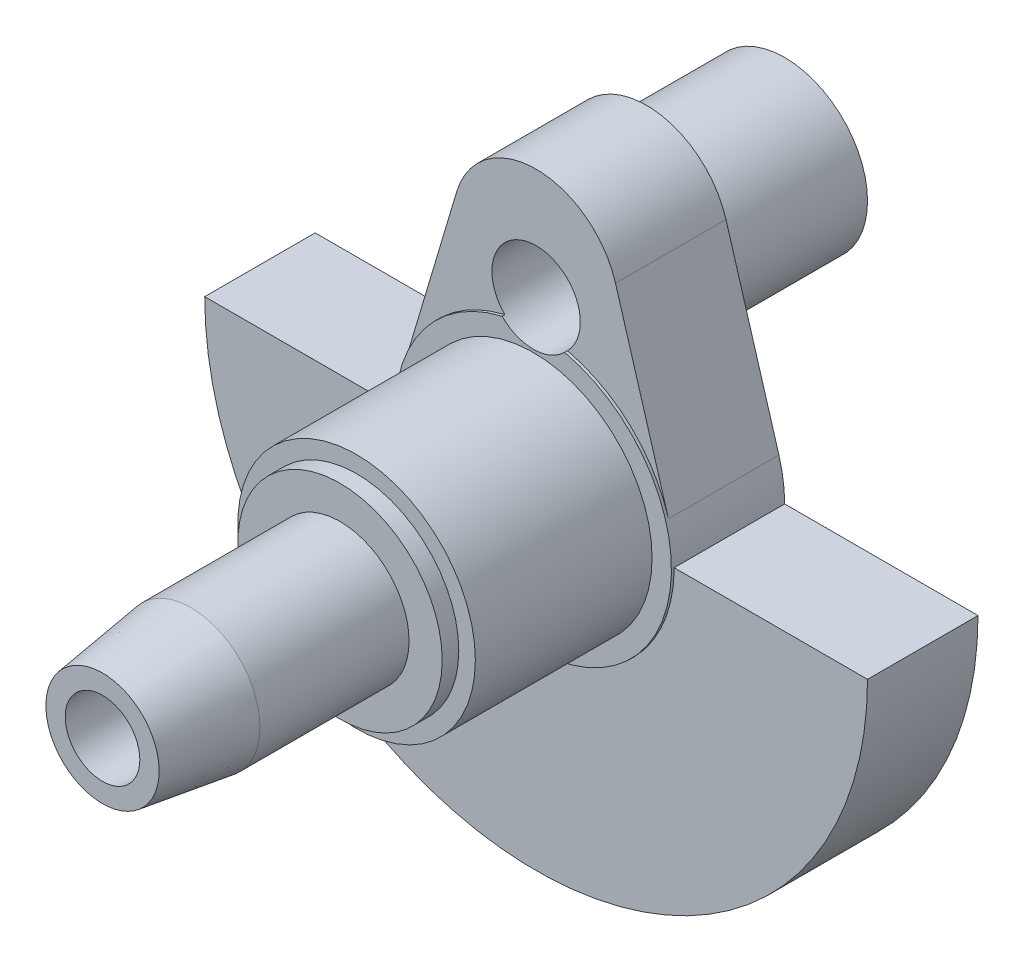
from build123d import *

# Parameters (mm, degrees)
BOSS_EXTRUDE1_DEPTH      = 1
BOSS_EXTRUDE1_DEPTH_BACK = 40
SKETCH1_R                = 50
BOSS_EXTRUDE2_DEPTH      = 40
SKETCH3_R                = 25
BOSS_EXTRUDE3_DEPTH      = 32
BOSS_EXTRUDE3_TAPER      = 8
SKETCH4_R                = 30
BOSS_EXTRUDE4_DEPTH      = 50
SKETCH5_R                = 21
CUT_EXTRUDE1_DEPTH       = 25
CUT_EXTRUDE2_REACH       = 281.435
SKETCH6_R                = 11
CUT_EXTRUDE3_START       = -41
SKETCH7_R                = 16
CUT_EXTRUDE3_DEPTH       = 41
SKETCH8_R                = 13.50269329
CUT_EXTRUDE4_DEPTH       = 30


with BuildPart() as part:
    # Sketch1 → Boss-Extrude1 (new, two sides: drawn at the far end of the back side and taken through both)
    with BuildSketch(Plane.XY.offset(-BOSS_EXTRUDE1_DEPTH_BACK)):
        Circle(SKETCH1_R)
    extrude(amount=BOSS_EXTRUDE1_DEPTH + BOSS_EXTRUDE1_DEPTH_BACK)

    # Sketch1_3 → Boss-Extrude2 (add)
    with BuildSketch(Plane.XY):
        with BuildLine():
            ThreePointArc((50, 0), (0, -50), (-50, 0))
            Line((-50, 0), (-120, 0))
            ThreePointArc((-120, 0), (0, -120), (120, 0))
            Line((120, 0), (50, 0))
        make_face()
        with BuildLine():
            ThreePointArc((28.749445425, 78.571428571), (0, 100), (-28.749445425, 78.571428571))
            Line((-28.749445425, 78.571428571), (-47.915742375, 14.285714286))
            ThreePointArc((-47.915742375, 14.285714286), (0, 50), (47.915742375, 14.285714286))
            Line((47.915742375, 14.285714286), (28.749445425, 78.571428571))
        make_face()
    extrude(amount=-BOSS_EXTRUDE2_DEPTH)

    # Sketch2 → Revolve1 (revolve)
    with BuildSketch(Plane(origin=(0, 0, 0), x_dir=(0, 0, -1), z_dir=(1, 0, 0)), mode=Mode.PRIVATE) as revolve1_sk:
        Polygon((-1, 0), (-1, 43), (-65, 43), (-65, 37), (-71, 37), (-71, 25), (-125, 25), (-125, 0), align=None)
    revolve(revolve1_sk.sketch.rotate(Axis((0, 0, 125), (0, 0, -1)), 90), axis=Axis((0, 0, 125), (0, 0, -1)))

    # Sketch3 → Boss-Extrude3 (add)
    with BuildSketch(Plane.XY.offset(125)):
        Circle(SKETCH3_R)
    extrude(amount=BOSS_EXTRUDE3_DEPTH, taper=BOSS_EXTRUDE3_TAPER)

    # Sketch4 → Boss-Extrude4 (add)
    with BuildSketch(Plane(origin=(0, 0, -40), x_dir=(-1, 0, 0), z_dir=(0, 0, -1))):
        with Locations(Location((0, 60, 0), (0, 0, 180))):
            Circle(SKETCH4_R)
    extrude(amount=BOSS_EXTRUDE4_DEPTH)

    # Sketch5 → Cut-Extrude1 (cut)
    with BuildSketch(Plane(origin=(0, 0, -90), x_dir=(-1, 0, 0), z_dir=(0, 0, -1))):
        with Locations((0, 60)):
            Circle(SKETCH5_R)
    extrude(amount=-CUT_EXTRUDE1_DEPTH, mode=Mode.SUBTRACT)

    # Cut-Extrude2: up to this face of the body (flat: up to its plane)
    cut_extrude2_end = Plane(part.part.faces().sort_by_distance((-48.585786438, 0, 1))[0])
    # Sketch6 → Cut-Extrude2 (cut, up to the picked face)
    with BuildSketch(Plane(origin=(0, 0, -65), x_dir=(-1, 0, 0), z_dir=(0, 0, -1)), mode=Mode.PRIVATE) as cut_extrude2_sk1:
        with Locations((0, 60)):
            Circle(SKETCH6_R)
    cut_extrude2_tool1 = split(extrude(cut_extrude2_sk1.sketch, amount=-CUT_EXTRUDE2_REACH, mode=Mode.PRIVATE), bisect_by=cut_extrude2_end, keep=Keep.BOTH, mode=Mode.PRIVATE)
    add(cut_extrude2_tool1.solids().sort_by(Axis((0, 60, -65), (0, 0, 1)))[0], mode=Mode.SUBTRACT)

    # Sketch7 → Cut-Extrude3 (cut)
    with BuildSketch(Plane(origin=(0, 0, -40), x_dir=(-1, 0, 0), z_dir=(0, 0, -1)).offset(CUT_EXTRUDE3_START)):
        with Locations((0, 60)):
            Circle(SKETCH7_R)
    extrude(amount=CUT_EXTRUDE3_DEPTH, mode=Mode.SUBTRACT)

    # Sketch8 → Cut-Extrude4 (cut)
    with BuildSketch(Plane.XY.offset(157)):
        Circle(SKETCH8_R)
    extrude(amount=-CUT_EXTRUDE4_DEPTH, mode=Mode.SUBTRACT)


solid = part.part
